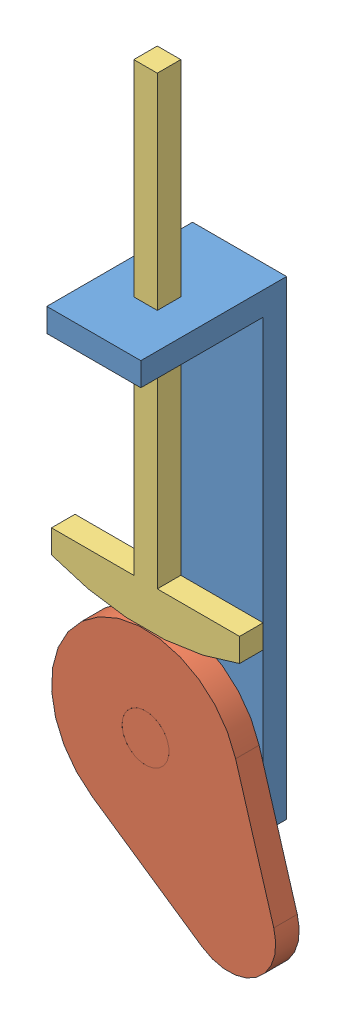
SolidWorks assembly cam_follower.SLDASM, configuration Default (file format 7000). Lengths in mm.
Overall size (67.69 167.8 31).
3 component instances, 3 part files, 5 mates.
Components (placement in the parent):
- base-1: base.sldprt [Default] at (-79.604 87.1049 -3.9794) size (20 100 31)
- cam-1: cam.sldprt [Default] at (-69.604 7.1049 11.0206) x (-0.807476 -0.589901 0) z (0.589901 -0.807476 0) size (40 20 60)
- follower-1: follower.sldprt [Default] at (-69.4229 42.0015 16.0206) x (1 0 0) z (0 1 0) size (40 5 103.71)
Mates (geometry in assembly coordinates):
- Concentric1: concentric anti-aligned: cylinder of base-1 through (-69.604 7.1049 -18.9794) axis (0 0 1) radius 5; cylinder of cam-1 through (-69.604 7.1049 30.1627) axis (0 0 -1) radius 5
- Coincident1: coincident anti-aligned: plane of base-1 through (-67.104 97.1049 11.0206) normal (-1 0 0); plane of follower-1 through (-67.104 130.811 11.0206) normal (1 0 0)
- Coincident2: coincident anti-aligned: plane of base-1 through (-72.104 97.1049 16.0206) normal (0 0 -1); plane of follower-1 through (-69.604 82.9231 16.0206) normal (0 0 1)
- CamMateTangent1: cam tangent: plane of cam-1; cylinder of cam-1 through (-51.907 -17.1194 16.0206) axis (0 0 -1) radius 10; cylinder of cam-1 through (-69.604 7.1049 16.0206) axis (0 0 -1) radius 20; plane of cam-1; cylinder of follower-1 through (-69.604 82.9231 11.0206) axis (0 0 1) radius 55.8183
- Coincident3: coincident aligned: plane of cam-1 through (-69.604 7.1049 16.0206) normal (0 0 1); plane of follower-1 through (-69.604 82.9231 16.0206) normal (0 0 1)
